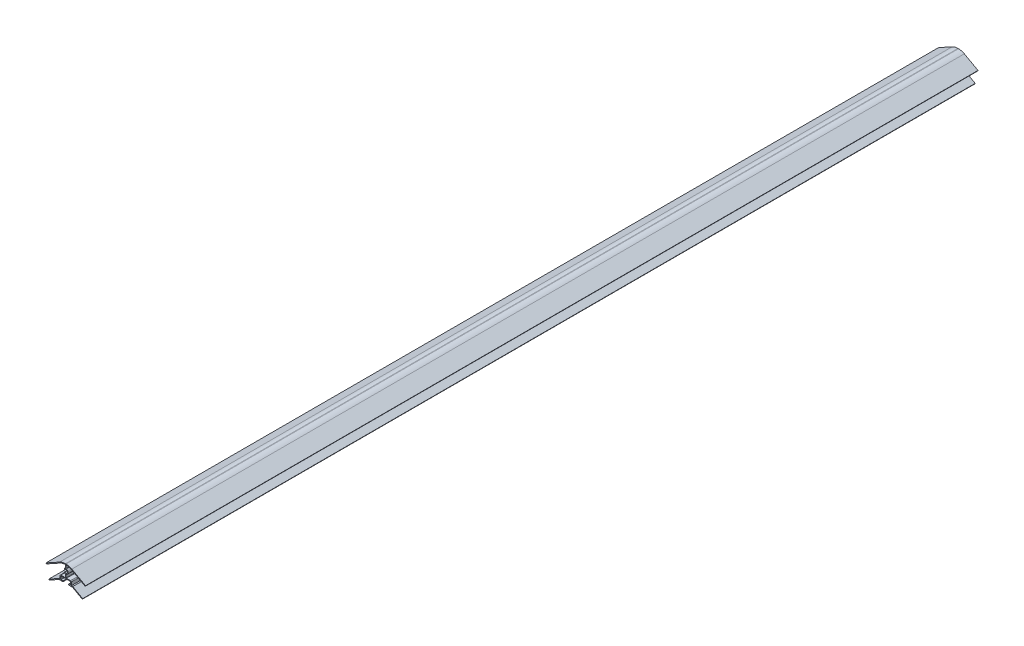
from build123d import *

# Parameters (mm, degrees)
BOSS_EXTRU_1_DEPTH = 1118


with BuildPart() as part:
    # Esquisse1 → Boss.-Extru.1 (new body)
    with BuildSketch(Plane.XY):
        with BuildLine():
            Line((-7.642880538, 6.230451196), (-24.75, -3.252179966))
            Line((-24.75, -3.252179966), (-24.26519038, -4.126799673))
            Line((-24.26519038, -4.126799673), (-7.158070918, 5.355831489))
            ThreePointArc((-7.158070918, 5.355831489), (-4.139180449, 6.594435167), (-0.915566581, 7.100550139))
            ThreePointArc((-0.915566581, 7.100550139), (-0.622715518, 6.989146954), (-0.5, 6.700853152))
            Line((-0.5, 6.700853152), (-0.5, 3.278719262))
            ThreePointArc((-0.5, 3.278719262), (-0.58191751, 3.036183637), (-0.794117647, 2.892987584))
            ThreePointArc((-0.794117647, 2.892987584), (-1.303326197, 2.702099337), (-1.769708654, 2.422422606))
            ThreePointArc((-1.769708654, 2.422422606), (-1.932555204, 2.130294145), (-1.816590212, 1.816590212))
            Line((-1.816590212, 1.816590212), (-1.673320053, 1.673320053))
            ThreePointArc((-1.673320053, 1.673320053), (-1.423927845, 1.55756389), (-1.158731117, 1.630135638))
            ThreePointArc((-1.158731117, 1.630135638), (2, 0), (-1.158731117, -1.630135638))
            ThreePointArc((-1.158731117, -1.630135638), (-1.423927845, -1.55756389), (-1.673320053, -1.673320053))
            Line((-1.673320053, -1.673320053), (-1.816590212, -1.816590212))
            ThreePointArc((-1.816590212, -1.816590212), (-1.932555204, -2.130294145), (-1.769708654, -2.422422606))
            ThreePointArc((-1.769708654, -2.422422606), (-1.303326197, -2.702099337), (-0.794117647, -2.892987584))
            ThreePointArc((-0.794117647, -2.892987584), (-0.58191751, -3.036183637), (-0.5, -3.278719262))
            Line((-0.5, -3.278719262), (-0.5, -6.71))
            ThreePointArc((-0.5, -6.71), (-0.617157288, -6.992842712), (-0.9, -7.11))
            Line((-0.9, -7.11), (-6, -7.11))
            ThreePointArc((-6, -7.11), (-6.707106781, -7.402893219), (-7, -8.11))
            Line((-7, -8.11), (-7, -12.11))
            Line((-7, -12.11), (-8.758617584, -12.11))
            Line((-8.758617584, -12.11), (-21.22948552, -19.022714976))
            Line((-21.22948552, -19.022714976), (-20.7446759, -19.897334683))
            Line((-20.7446759, -19.897334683), (-8.5, -13.11))
            Line((-8.5, -13.11), (-3.5, -13.11))
            Line((-3.5, -13.11), (-3.5, -12.11))
            Line((-3.5, -12.11), (-6, -12.11))
            Line((-6, -12.11), (-6, -8.11))
            Line((-6, -8.11), (6, -8.11))
            Line((6, -8.11), (6, -12.11))
            Line((6, -12.11), (3.5, -12.11))
            Line((3.5, -12.11), (3.5, -13.11))
            Line((3.5, -13.11), (8.5, -13.11))
            Line((8.5, -13.11), (20.7446759, -19.897334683))
            Line((20.7446759, -19.897334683), (21.22948552, -19.022714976))
            Line((21.22948552, -19.022714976), (8.758617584, -12.11))
            Line((8.758617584, -12.11), (7, -12.11))
            Line((7, -12.11), (7, -8.11))
            ThreePointArc((7, -8.11), (6.707106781, -7.402893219), (6, -7.11))
            Line((6, -7.11), (0.9, -7.11))
            ThreePointArc((0.9, -7.11), (0.617157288, -6.992842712), (0.5, -6.71))
            Line((0.5, -6.71), (0.5, -3.278719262))
            ThreePointArc((0.5, -3.278719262), (0.58191751, -3.036183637), (0.794117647, -2.892987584))
            ThreePointArc((0.794117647, -2.892987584), (3, 0), (0.794117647, 2.892987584))
            ThreePointArc((0.794117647, 2.892987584), (0.58191751, 3.036183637), (0.5, 3.278719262))
            Line((0.5, 3.278719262), (0.5, 6.700853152))
            ThreePointArc((0.5, 6.700853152), (0.622715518, 6.989146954), (0.915566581, 7.100550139))
            ThreePointArc((0.915566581, 7.100550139), (4.139180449, 6.594435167), (7.158070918, 5.355831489))
            Line((7.158070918, 5.355831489), (24.26519038, -4.126799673))
            Line((24.26519038, -4.126799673), (24.75, -3.252179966))
            Line((24.75, -3.252179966), (7.642880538, 6.230451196))
            ThreePointArc((7.642880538, 6.230451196), (4.126436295, 7.633370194), (0.370736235, 8.111155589))
            Line((0.370736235, 8.111155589), (-0.370736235, 8.111155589))
            ThreePointArc((-0.370736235, 8.111155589), (-4.126436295, 7.633370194), (-7.642880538, 6.230451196))
        make_face()
    extrude(amount=-BOSS_EXTRU_1_DEPTH)


solid = part.part
